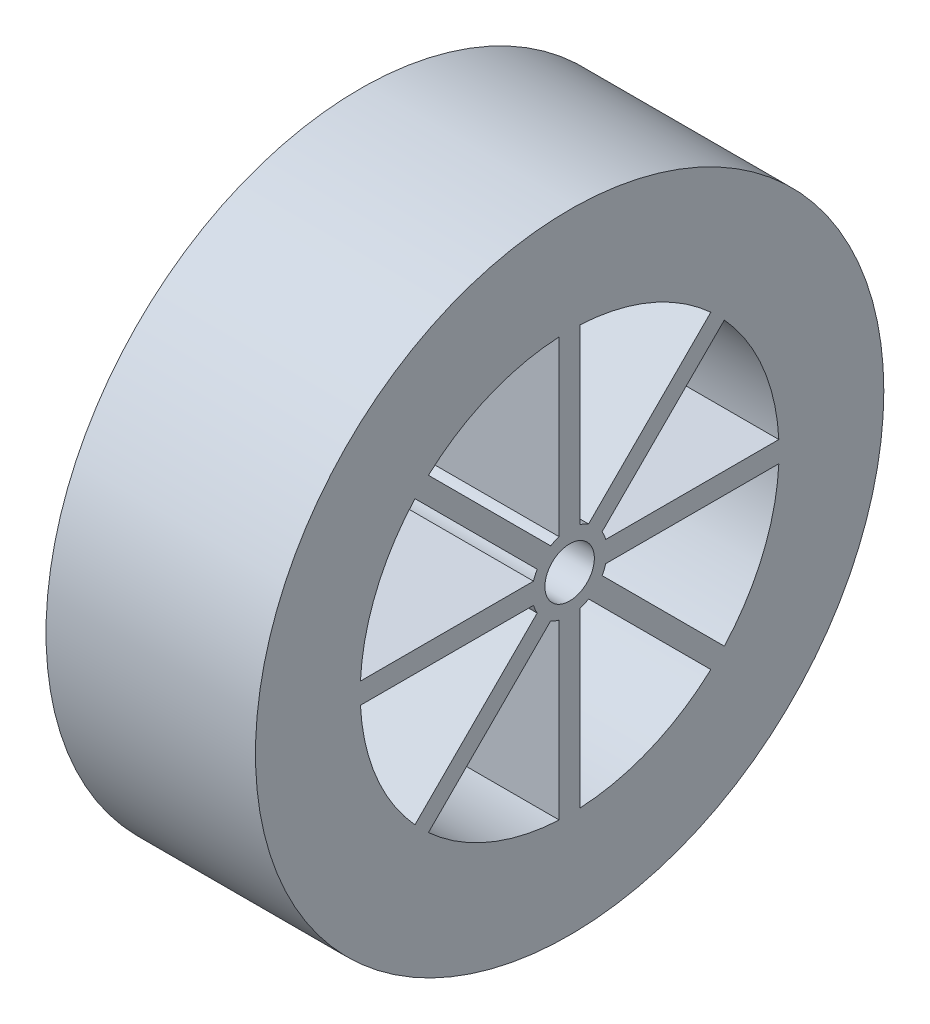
ISO-10303-21;
HEADER;
FILE_DESCRIPTION(('STEP AP214'),'2;1');
FILE_NAME('part.step','',(''),(''),'','','');
FILE_SCHEMA(('AUTOMOTIVE_DESIGN { 1 0 10303 214 1 1 1 1 }'));
ENDSEC;
DATA;
#1=APPLICATION_CONTEXT('core data for automotive mechanical design processes');
#2=APPLICATION_PROTOCOL_DEFINITION('international standard','automotive_design',2000,#1);
#3=PRODUCT_CONTEXT('',#1,'mechanical');
#4=PRODUCT('Part','Part','',(#3));
#5=PRODUCT_RELATED_PRODUCT_CATEGORY('part','',(#4));
#6=PRODUCT_DEFINITION_FORMATION('','',#4);
#7=PRODUCT_DEFINITION_CONTEXT('part definition',#1,'design');
#8=PRODUCT_DEFINITION('design','',#6,#7);
#9=PRODUCT_DEFINITION_SHAPE('','',#8);
#10=(LENGTH_UNIT() NAMED_UNIT(*) SI_UNIT(.MILLI.,.METRE.));
#11=(NAMED_UNIT(*) PLANE_ANGLE_UNIT() SI_UNIT($,.RADIAN.));
#12=(NAMED_UNIT(*) SI_UNIT($,.STERADIAN.) SOLID_ANGLE_UNIT());
#13=UNCERTAINTY_MEASURE_WITH_UNIT(LENGTH_MEASURE(1.E-05),#10,'distance_accuracy_value','');
#14=(GEOMETRIC_REPRESENTATION_CONTEXT(3) GLOBAL_UNCERTAINTY_ASSIGNED_CONTEXT((#13)) GLOBAL_UNIT_ASSIGNED_CONTEXT((#10,
#11,#12)) REPRESENTATION_CONTEXT('',''));
#15=CARTESIAN_POINT('',(0.,0.,0.));
#16=DIRECTION('',(0.,0.,1.));
#17=DIRECTION('',(1.,0.,0.));
#18=AXIS2_PLACEMENT_3D('',#15,#16,#17);
#19=CARTESIAN_POINT('',(12.7,0.,0.));
#20=DIRECTION('',(-1.,0.,0.));
#21=DIRECTION('',(0.,0.,1.));
#22=AXIS2_PLACEMENT_3D('',#19,#20,#21);
#23=CYLINDRICAL_SURFACE('',#22,2.28043976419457);
#24=CARTESIAN_POINT('',(0.,0.,0.));
#25=DIRECTION('',(1.,0.,0.));
#26=DIRECTION('',(0.,0.,-1.));
#27=AXIS2_PLACEMENT_3D('',#24,#25,#26);
#28=CIRCLE('',#27,2.28043976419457);
#29=CARTESIAN_POINT('',(0.,-1.15159574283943,-1.96830708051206));
#30=VERTEX_POINT('',#29);
#31=CARTESIAN_POINT('',(0.,-0.635,-2.19024667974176));
#32=VERTEX_POINT('',#31);
#33=EDGE_CURVE('E296',#30,#32,#28,.T.);
#34=ORIENTED_EDGE('',*,*,#33,.T.);
#35=DIRECTION('',(-1.,0.,0.));
#36=VECTOR('',#35,1.);
#37=CARTESIAN_POINT('',(12.7,-0.635,-2.19024667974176));
#38=LINE('',#37,#36);
#39=CARTESIAN_POINT('',(12.7,-0.635,-2.19024667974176));
#40=VERTEX_POINT('',#39);
#41=EDGE_CURVE('E11',#40,#32,#38,.T.);
#42=ORIENTED_EDGE('',*,*,#41,.F.);
#43=CARTESIAN_POINT('',(12.7,0.,0.));
#44=DIRECTION('',(1.,0.,0.));
#45=DIRECTION('',(0.,0.,-1.));
#46=AXIS2_PLACEMENT_3D('',#43,#44,#45);
#47=CIRCLE('',#46,2.28043976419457);
#48=CARTESIAN_POINT('',(12.7,-1.15159574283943,-1.96830708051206));
#49=VERTEX_POINT('',#48);
#50=EDGE_CURVE('E269',#49,#40,#47,.T.);
#51=ORIENTED_EDGE('',*,*,#50,.F.);
#52=DIRECTION('',(-1.,0.,0.));
#53=VECTOR('',#52,1.);
#54=CARTESIAN_POINT('',(12.7,-1.15159574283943,-1.96830708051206));
#55=LINE('',#54,#53);
#56=EDGE_CURVE('E63',#49,#30,#55,.T.);
#57=ORIENTED_EDGE('',*,*,#56,.T.);
#58=EDGE_LOOP('',(#34,#42,#51,#57));
#59=FACE_BOUND('',#58,.T.);
#60=ADVANCED_FACE('F44',(#59),#23,.T.);
#61=CARTESIAN_POINT('',(12.7,-0.635,0.));
#62=DIRECTION('',(0.,1.,0.));
#63=DIRECTION('',(0.,0.,1.));
#64=AXIS2_PLACEMENT_3D('',#61,#62,#63);
#65=PLANE('',#64);
#66=DIRECTION('',(0.,0.,-1.));
#67=VECTOR('',#66,1.);
#68=CARTESIAN_POINT('',(0.,-0.635,0.));
#69=LINE('',#68,#67);
#70=CARTESIAN_POINT('',(0.,-0.635,-12.6841150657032));
#71=VERTEX_POINT('',#70);
#72=EDGE_CURVE('E277',#32,#71,#69,.T.);
#73=ORIENTED_EDGE('',*,*,#72,.T.);
#74=DIRECTION('',(-1.,0.,0.));
#75=VECTOR('',#74,1.);
#76=CARTESIAN_POINT('',(12.7,-0.635,-12.6841150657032));
#77=LINE('',#76,#75);
#78=CARTESIAN_POINT('',(12.7,-0.635,-12.6841150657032));
#79=VERTEX_POINT('',#78);
#80=EDGE_CURVE('E54',#79,#71,#77,.T.);
#81=ORIENTED_EDGE('',*,*,#80,.F.);
#82=DIRECTION('',(0.,0.,-1.));
#83=VECTOR('',#82,1.);
#84=CARTESIAN_POINT('',(12.7,-0.635,0.));
#85=LINE('',#84,#83);
#86=EDGE_CURVE('E263',#40,#79,#85,.T.);
#87=ORIENTED_EDGE('',*,*,#86,.F.);
#88=ORIENTED_EDGE('',*,*,#41,.T.);
#89=EDGE_LOOP('',(#73,#81,#87,#88));
#90=FACE_BOUND('',#89,.T.);
#91=ADVANCED_FACE('F274',(#90),#65,.F.);
#92=CARTESIAN_POINT('',(12.7,0.,0.));
#93=DIRECTION('',(-1.,0.,0.));
#94=DIRECTION('',(0.,0.,1.));
#95=AXIS2_PLACEMENT_3D('',#92,#93,#94);
#96=CYLINDRICAL_SURFACE('',#95,12.7);
#97=CARTESIAN_POINT('',(0.,0.,0.));
#98=DIRECTION('',(1.,0.,0.));
#99=DIRECTION('',(0.,0.,-1.));
#100=AXIS2_PLACEMENT_3D('',#97,#98,#99);
#101=CIRCLE('',#100,12.7);
#102=CARTESIAN_POINT('',(0.,-8.56261114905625,-9.37932248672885));
#103=VERTEX_POINT('',#102);
#104=EDGE_CURVE('E361',#103,#71,#101,.T.);
#105=ORIENTED_EDGE('',*,*,#104,.F.);
#106=DIRECTION('',(-1.,0.,0.));
#107=VECTOR('',#106,1.);
#108=CARTESIAN_POINT('',(12.7,-8.56261114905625,-9.37932248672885));
#109=LINE('',#108,#107);
#110=CARTESIAN_POINT('',(12.7,-8.56261114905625,-9.37932248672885));
#111=VERTEX_POINT('',#110);
#112=EDGE_CURVE('E165',#111,#103,#109,.T.);
#113=ORIENTED_EDGE('',*,*,#112,.F.);
#114=CARTESIAN_POINT('',(12.7,0.,0.));
#115=DIRECTION('',(1.,0.,0.));
#116=DIRECTION('',(0.,0.,-1.));
#117=AXIS2_PLACEMENT_3D('',#114,#115,#116);
#118=CIRCLE('',#117,12.7);
#119=EDGE_CURVE('E267',#111,#79,#118,.T.);
#120=ORIENTED_EDGE('',*,*,#119,.T.);
#121=ORIENTED_EDGE('',*,*,#80,.T.);
#122=EDGE_LOOP('',(#105,#113,#120,#121));
#123=FACE_BOUND('',#122,.T.);
#124=ADVANCED_FACE('F278',(#123),#96,.F.);
#125=CARTESIAN_POINT('',(12.7,0.,-0.635));
#126=DIRECTION('',(0.,0.,1.));
#127=DIRECTION('',(1.,0.,0.));
#128=AXIS2_PLACEMENT_3D('',#125,#126,#127);
#129=PLANE('',#128);
#130=DIRECTION('',(0.,1.,0.));
#131=VECTOR('',#130,1.);
#132=CARTESIAN_POINT('',(0.,0.,-0.635));
#133=LINE('',#132,#131);
#134=CARTESIAN_POINT('',(0.,-12.6841150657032,-0.635));
#135=VERTEX_POINT('',#134);
#136=CARTESIAN_POINT('',(0.,-2.19024667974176,-0.635));
#137=VERTEX_POINT('',#136);
#138=EDGE_CURVE('E355',#135,#137,#133,.T.);
#139=ORIENTED_EDGE('',*,*,#138,.T.);
#140=DIRECTION('',(-1.,0.,0.));
#141=VECTOR('',#140,1.);
#142=CARTESIAN_POINT('',(12.7,-2.19024667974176,-0.635));
#143=LINE('',#142,#141);
#144=CARTESIAN_POINT('',(12.7,-2.19024667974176,-0.635));
#145=VERTEX_POINT('',#144);
#146=EDGE_CURVE('E373',#145,#137,#143,.T.);
#147=ORIENTED_EDGE('',*,*,#146,.F.);
#148=DIRECTION('',(0.,1.,0.));
#149=VECTOR('',#148,1.);
#150=CARTESIAN_POINT('',(12.7,0.,-0.635));
#151=LINE('',#150,#149);
#152=CARTESIAN_POINT('',(12.7,-12.6841150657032,-0.635));
#153=VERTEX_POINT('',#152);
#154=EDGE_CURVE('E510',#153,#145,#151,.T.);
#155=ORIENTED_EDGE('',*,*,#154,.F.);
#156=DIRECTION('',(-1.,0.,0.));
#157=VECTOR('',#156,1.);
#158=CARTESIAN_POINT('',(12.7,-12.6841150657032,-0.635));
#159=LINE('',#158,#157);
#160=EDGE_CURVE('E374',#153,#135,#159,.T.);
#161=ORIENTED_EDGE('',*,*,#160,.T.);
#162=EDGE_LOOP('',(#139,#147,#155,#161));
#163=FACE_BOUND('',#162,.T.);
#164=ADVANCED_FACE('F587',(#163),#129,.F.);
#165=CARTESIAN_POINT('',(0.,-1.9695081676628,-1.14954038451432));
#166=VERTEX_POINT('',#165);
#167=EDGE_CURVE('E354',#137,#166,#28,.T.);
#168=ORIENTED_EDGE('',*,*,#167,.T.);
#169=DIRECTION('',(-1.,0.,0.));
#170=VECTOR('',#169,1.);
#171=CARTESIAN_POINT('',(12.7,-1.9695081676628,-1.14954038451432));
#172=LINE('',#171,#170);
#173=CARTESIAN_POINT('',(12.7,-1.9695081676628,-1.14954038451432));
#174=VERTEX_POINT('',#173);
#175=EDGE_CURVE('E379',#174,#166,#172,.T.);
#176=ORIENTED_EDGE('',*,*,#175,.F.);
#177=EDGE_CURVE('E507',#145,#174,#47,.T.);
#178=ORIENTED_EDGE('',*,*,#177,.F.);
#179=ORIENTED_EDGE('',*,*,#146,.T.);
#180=EDGE_LOOP('',(#168,#176,#178,#179));
#181=FACE_BOUND('',#180,.T.);
#182=ADVANCED_FACE('F582',(#181),#23,.T.);
#183=CARTESIAN_POINT('',(12.7,-0.409983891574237,0.409983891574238));
#184=DIRECTION('',(0.,0.707106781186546,-0.707106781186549));
#185=DIRECTION('',(0.,0.707106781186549,0.707106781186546));
#186=AXIS2_PLACEMENT_3D('',#183,#184,#185);
#187=PLANE('',#186);
#188=DIRECTION('',(0.,-0.707106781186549,-0.707106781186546));
#189=VECTOR('',#188,1.);
#190=CARTESIAN_POINT('',(0.,-0.409983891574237,0.409983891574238));
#191=LINE('',#190,#189);
#192=CARTESIAN_POINT('',(0.,-9.38087644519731,-8.5609086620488));
#193=VERTEX_POINT('',#192);
#194=EDGE_CURVE('E358',#166,#193,#191,.T.);
#195=ORIENTED_EDGE('',*,*,#194,.T.);
#196=DIRECTION('',(-1.,0.,0.));
#197=VECTOR('',#196,1.);
#198=CARTESIAN_POINT('',(12.7,-9.38087644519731,-8.5609086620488));
#199=LINE('',#198,#197);
#200=CARTESIAN_POINT('',(12.7,-9.38087644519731,-8.5609086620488));
#201=VERTEX_POINT('',#200);
#202=EDGE_CURVE('E380',#201,#193,#199,.T.);
#203=ORIENTED_EDGE('',*,*,#202,.F.);
#204=DIRECTION('',(0.,-0.707106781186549,-0.707106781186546));
#205=VECTOR('',#204,1.);
#206=CARTESIAN_POINT('',(12.7,-0.409983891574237,0.409983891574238));
#207=LINE('',#206,#205);
#208=EDGE_CURVE('E512',#174,#201,#207,.T.);
#209=ORIENTED_EDGE('',*,*,#208,.F.);
#210=ORIENTED_EDGE('',*,*,#175,.T.);
#211=EDGE_LOOP('',(#195,#203,#209,#210));
#212=FACE_BOUND('',#211,.T.);
#213=ADVANCED_FACE('F589',(#212),#187,.F.);
#214=CARTESIAN_POINT('',(12.7,-0.409983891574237,-0.409983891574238));
#215=DIRECTION('',(0.,-0.707106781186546,-0.707106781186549));
#216=DIRECTION('',(0.,0.707106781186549,-0.707106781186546));
#217=AXIS2_PLACEMENT_3D('',#214,#215,#216);
#218=PLANE('',#217);
#219=DIRECTION('',(0.,-0.707106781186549,0.707106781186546));
#220=VECTOR('',#219,1.);
#221=CARTESIAN_POINT('',(0.,-0.409983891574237,-0.409983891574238));
#222=LINE('',#221,#220);
#223=CARTESIAN_POINT('',(0.,-1.9695081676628,1.14954038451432));
#224=VERTEX_POINT('',#223);
#225=CARTESIAN_POINT('',(0.,-9.38087644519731,8.5609086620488));
#226=VERTEX_POINT('',#225);
#227=EDGE_CURVE('E345',#224,#226,#222,.T.);
#228=ORIENTED_EDGE('',*,*,#227,.F.);
#229=DIRECTION('',(-1.,0.,0.));
#230=VECTOR('',#229,1.);
#231=CARTESIAN_POINT('',(12.7,-1.9695081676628,1.14954038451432));
#232=LINE('',#231,#230);
#233=CARTESIAN_POINT('',(12.7,-1.9695081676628,1.14954038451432));
#234=VERTEX_POINT('',#233);
#235=EDGE_CURVE('E378',#234,#224,#232,.T.);
#236=ORIENTED_EDGE('',*,*,#235,.F.);
#237=DIRECTION('',(0.,-0.707106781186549,0.707106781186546));
#238=VECTOR('',#237,1.);
#239=CARTESIAN_POINT('',(12.7,-0.409983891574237,-0.409983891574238));
#240=LINE('',#239,#238);
#241=CARTESIAN_POINT('',(12.7,-9.38087644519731,8.5609086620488));
#242=VERTEX_POINT('',#241);
#243=EDGE_CURVE('E500',#234,#242,#240,.T.);
#244=ORIENTED_EDGE('',*,*,#243,.T.);
#245=DIRECTION('',(-1.,0.,0.));
#246=VECTOR('',#245,1.);
#247=CARTESIAN_POINT('',(12.7,-9.38087644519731,8.5609086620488));
#248=LINE('',#247,#246);
#249=EDGE_CURVE('E384',#242,#226,#248,.T.);
#250=ORIENTED_EDGE('',*,*,#249,.T.);
#251=EDGE_LOOP('',(#228,#236,#244,#250));
#252=FACE_BOUND('',#251,.T.);
#253=ADVANCED_FACE('F596',(#252),#218,.T.);
#254=CARTESIAN_POINT('',(0.,-2.19024667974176,0.635));
#255=VERTEX_POINT('',#254);
#256=EDGE_CURVE('E342',#224,#255,#28,.T.);
#257=ORIENTED_EDGE('',*,*,#256,.T.);
#258=DIRECTION('',(-1.,0.,0.));
#259=VECTOR('',#258,1.);
#260=CARTESIAN_POINT('',(12.7,-2.19024667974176,0.635));
#261=LINE('',#260,#259);
#262=CARTESIAN_POINT('',(12.7,-2.19024667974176,0.635));
#263=VERTEX_POINT('',#262);
#264=EDGE_CURVE('E388',#263,#255,#261,.T.);
#265=ORIENTED_EDGE('',*,*,#264,.F.);
#266=EDGE_CURVE('E498',#234,#263,#47,.T.);
#267=ORIENTED_EDGE('',*,*,#266,.F.);
#268=ORIENTED_EDGE('',*,*,#235,.T.);
#269=EDGE_LOOP('',(#257,#265,#267,#268));
#270=FACE_BOUND('',#269,.T.);
#271=ADVANCED_FACE('F591',(#270),#23,.T.);
#272=CARTESIAN_POINT('',(12.7,0.,0.635));
#273=DIRECTION('',(0.,0.,1.));
#274=DIRECTION('',(0.,-1.,0.));
#275=AXIS2_PLACEMENT_3D('',#272,#273,#274);
#276=PLANE('',#275);
#277=DIRECTION('',(0.,1.,0.));
#278=VECTOR('',#277,1.);
#279=CARTESIAN_POINT('',(0.,0.,0.635));
#280=LINE('',#279,#278);
#281=CARTESIAN_POINT('',(0.,-12.6841150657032,0.635));
#282=VERTEX_POINT('',#281);
#283=EDGE_CURVE('E347',#282,#255,#280,.T.);
#284=ORIENTED_EDGE('',*,*,#283,.F.);
#285=DIRECTION('',(-1.,0.,0.));
#286=VECTOR('',#285,1.);
#287=CARTESIAN_POINT('',(12.7,-12.6841150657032,0.635));
#288=LINE('',#287,#286);
#289=CARTESIAN_POINT('',(12.7,-12.6841150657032,0.635));
#290=VERTEX_POINT('',#289);
#291=EDGE_CURVE('E390',#290,#282,#288,.T.);
#292=ORIENTED_EDGE('',*,*,#291,.F.);
#293=DIRECTION('',(0.,1.,0.));
#294=VECTOR('',#293,1.);
#295=CARTESIAN_POINT('',(12.7,0.,0.635));
#296=LINE('',#295,#294);
#297=EDGE_CURVE('E501',#290,#263,#296,.T.);
#298=ORIENTED_EDGE('',*,*,#297,.T.);
#299=ORIENTED_EDGE('',*,*,#264,.T.);
#300=EDGE_LOOP('',(#284,#292,#298,#299));
#301=FACE_BOUND('',#300,.T.);
#302=ADVANCED_FACE('F605',(#301),#276,.T.);
#303=CARTESIAN_POINT('',(12.7,-0.635,0.));
#304=DIRECTION('',(0.,1.,0.));
#305=DIRECTION('',(0.,0.,1.));
#306=AXIS2_PLACEMENT_3D('',#303,#304,#305);
#307=PLANE('',#306);
#308=DIRECTION('',(0.,0.,-1.));
#309=VECTOR('',#308,1.);
#310=CARTESIAN_POINT('',(0.,-0.635,0.));
#311=LINE('',#310,#309);
#312=CARTESIAN_POINT('',(0.,-0.635,12.6841150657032));
#313=VERTEX_POINT('',#312);
#314=CARTESIAN_POINT('',(0.,-0.635,2.19024667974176));
#315=VERTEX_POINT('',#314);
#316=EDGE_CURVE('E335',#313,#315,#311,.T.);
#317=ORIENTED_EDGE('',*,*,#316,.T.);
#318=DIRECTION('',(-1.,0.,0.));
#319=VECTOR('',#318,1.);
#320=CARTESIAN_POINT('',(12.7,-0.635,2.19024667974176));
#321=LINE('',#320,#319);
#322=CARTESIAN_POINT('',(12.7,-0.635,2.19024667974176));
#323=VERTEX_POINT('',#322);
#324=EDGE_CURVE('E389',#323,#315,#321,.T.);
#325=ORIENTED_EDGE('',*,*,#324,.F.);
#326=DIRECTION('',(0.,0.,-1.));
#327=VECTOR('',#326,1.);
#328=CARTESIAN_POINT('',(12.7,-0.635,0.));
#329=LINE('',#328,#327);
#330=CARTESIAN_POINT('',(12.7,-0.635,12.6841150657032));
#331=VERTEX_POINT('',#330);
#332=EDGE_CURVE('E488',#331,#323,#329,.T.);
#333=ORIENTED_EDGE('',*,*,#332,.F.);
#334=DIRECTION('',(-1.,0.,0.));
#335=VECTOR('',#334,1.);
#336=CARTESIAN_POINT('',(12.7,-0.635,12.6841150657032));
#337=LINE('',#336,#335);
#338=EDGE_CURVE('E392',#331,#313,#337,.T.);
#339=ORIENTED_EDGE('',*,*,#338,.T.);
#340=EDGE_LOOP('',(#317,#325,#333,#339));
#341=FACE_BOUND('',#340,.T.);
#342=ADVANCED_FACE('F609',(#341),#307,.F.);
#343=CARTESIAN_POINT('',(0.,-1.15159574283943,1.96830708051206));
#344=VERTEX_POINT('',#343);
#345=EDGE_CURVE('E333',#315,#344,#28,.T.);
#346=ORIENTED_EDGE('',*,*,#345,.T.);
#347=DIRECTION('',(-1.,0.,0.));
#348=VECTOR('',#347,1.);
#349=CARTESIAN_POINT('',(12.7,-1.15159574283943,1.96830708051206));
#350=LINE('',#349,#348);
#351=CARTESIAN_POINT('',(12.7,-1.15159574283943,1.96830708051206));
#352=VERTEX_POINT('',#351);
#353=EDGE_CURVE('E396',#352,#344,#350,.T.);
#354=ORIENTED_EDGE('',*,*,#353,.F.);
#355=EDGE_CURVE('E491',#323,#352,#47,.T.);
#356=ORIENTED_EDGE('',*,*,#355,.F.);
#357=ORIENTED_EDGE('',*,*,#324,.T.);
#358=EDGE_LOOP('',(#346,#354,#356,#357));
#359=FACE_BOUND('',#358,.T.);
#360=ADVANCED_FACE('F602',(#359),#23,.T.);
#361=CARTESIAN_POINT('',(12.7,0.408355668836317,0.408355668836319));
#362=DIRECTION('',(0.,-0.707106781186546,-0.707106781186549));
#363=DIRECTION('',(0.,0.707106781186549,-0.707106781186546));
#364=AXIS2_PLACEMENT_3D('',#361,#362,#363);
#365=PLANE('',#364);
#366=DIRECTION('',(0.,-0.707106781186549,0.707106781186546));
#367=VECTOR('',#366,1.);
#368=CARTESIAN_POINT('',(0.,0.408355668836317,0.408355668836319));
#369=LINE('',#368,#367);
#370=CARTESIAN_POINT('',(0.,-8.56261114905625,9.37932248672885));
#371=VERTEX_POINT('',#370);
#372=EDGE_CURVE('E336',#344,#371,#369,.T.);
#373=ORIENTED_EDGE('',*,*,#372,.T.);
#374=DIRECTION('',(-1.,0.,0.));
#375=VECTOR('',#374,1.);
#376=CARTESIAN_POINT('',(12.7,-8.56261114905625,9.37932248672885));
#377=LINE('',#376,#375);
#378=CARTESIAN_POINT('',(12.7,-8.56261114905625,9.37932248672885));
#379=VERTEX_POINT('',#378);
#380=EDGE_CURVE('E394',#379,#371,#377,.T.);
#381=ORIENTED_EDGE('',*,*,#380,.F.);
#382=DIRECTION('',(0.,-0.707106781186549,0.707106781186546));
#383=VECTOR('',#382,1.);
#384=CARTESIAN_POINT('',(12.7,0.408355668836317,0.408355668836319));
#385=LINE('',#384,#383);
#386=EDGE_CURVE('E495',#352,#379,#385,.T.);
#387=ORIENTED_EDGE('',*,*,#386,.F.);
#388=ORIENTED_EDGE('',*,*,#353,.T.);
#389=EDGE_LOOP('',(#373,#381,#387,#388));
#390=FACE_BOUND('',#389,.T.);
#391=ADVANCED_FACE('F613',(#390),#365,.F.);
#392=CARTESIAN_POINT('',(12.7,-0.408355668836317,0.408355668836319));
#393=DIRECTION('',(0.,-0.707106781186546,0.707106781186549));
#394=DIRECTION('',(0.,-0.707106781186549,-0.707106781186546));
#395=AXIS2_PLACEMENT_3D('',#392,#393,#394);
#396=PLANE('',#395);
#397=DIRECTION('',(0.,0.707106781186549,0.707106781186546));
#398=VECTOR('',#397,1.);
#399=CARTESIAN_POINT('',(0.,-0.408355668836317,0.408355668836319));
#400=LINE('',#399,#398);
#401=CARTESIAN_POINT('',(0.,1.15159574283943,1.96830708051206));
#402=VERTEX_POINT('',#401);
#403=CARTESIAN_POINT('',(0.,8.56261114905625,9.37932248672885));
#404=VERTEX_POINT('',#403);
#405=EDGE_CURVE('E325',#402,#404,#400,.T.);
#406=ORIENTED_EDGE('',*,*,#405,.F.);
#407=DIRECTION('',(-1.,0.,0.));
#408=VECTOR('',#407,1.);
#409=CARTESIAN_POINT('',(12.7,1.15159574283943,1.96830708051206));
#410=LINE('',#409,#408);
#411=CARTESIAN_POINT('',(12.7,1.15159574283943,1.96830708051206));
#412=VERTEX_POINT('',#411);
#413=EDGE_CURVE('E398',#412,#402,#410,.T.);
#414=ORIENTED_EDGE('',*,*,#413,.F.);
#415=DIRECTION('',(0.,0.707106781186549,0.707106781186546));
#416=VECTOR('',#415,1.);
#417=CARTESIAN_POINT('',(12.7,-0.408355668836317,0.408355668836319));
#418=LINE('',#417,#416);
#419=CARTESIAN_POINT('',(12.7,8.56261114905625,9.37932248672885));
#420=VERTEX_POINT('',#419);
#421=EDGE_CURVE('E476',#412,#420,#418,.T.);
#422=ORIENTED_EDGE('',*,*,#421,.T.);
#423=DIRECTION('',(-1.,0.,0.));
#424=VECTOR('',#423,1.);
#425=CARTESIAN_POINT('',(12.7,8.56261114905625,9.37932248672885));
#426=LINE('',#425,#424);
#427=EDGE_CURVE('E401',#420,#404,#426,.T.);
#428=ORIENTED_EDGE('',*,*,#427,.T.);
#429=EDGE_LOOP('',(#406,#414,#422,#428));
#430=FACE_BOUND('',#429,.T.);
#431=ADVANCED_FACE('F617',(#430),#396,.T.);
#432=CARTESIAN_POINT('',(0.,0.635,2.19024667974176));
#433=VERTEX_POINT('',#432);
#434=EDGE_CURVE('E324',#402,#433,#28,.T.);
#435=ORIENTED_EDGE('',*,*,#434,.T.);
#436=DIRECTION('',(-1.,0.,0.));
#437=VECTOR('',#436,1.);
#438=CARTESIAN_POINT('',(12.7,0.635,2.19024667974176));
#439=LINE('',#438,#437);
#440=CARTESIAN_POINT('',(12.7,0.635,2.19024667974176));
#441=VERTEX_POINT('',#440);
#442=EDGE_CURVE('E407',#441,#433,#439,.T.);
#443=ORIENTED_EDGE('',*,*,#442,.F.);
#444=EDGE_CURVE('E481',#412,#441,#47,.T.);
#445=ORIENTED_EDGE('',*,*,#444,.F.);
#446=ORIENTED_EDGE('',*,*,#413,.T.);
#447=EDGE_LOOP('',(#435,#443,#445,#446));
#448=FACE_BOUND('',#447,.T.);
#449=ADVANCED_FACE('F614',(#448),#23,.T.);
#450=CARTESIAN_POINT('',(12.7,0.635,0.));
#451=DIRECTION('',(0.,1.,0.));
#452=DIRECTION('',(0.,0.,1.));
#453=AXIS2_PLACEMENT_3D('',#450,#451,#452);
#454=PLANE('',#453);
#455=DIRECTION('',(0.,0.,-1.));
#456=VECTOR('',#455,1.);
#457=CARTESIAN_POINT('',(0.,0.635,0.));
#458=LINE('',#457,#456);
#459=CARTESIAN_POINT('',(0.,0.635,12.6841150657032));
#460=VERTEX_POINT('',#459);
#461=EDGE_CURVE('E326',#460,#433,#458,.T.);
#462=ORIENTED_EDGE('',*,*,#461,.F.);
#463=DIRECTION('',(-1.,0.,0.));
#464=VECTOR('',#463,1.);
#465=CARTESIAN_POINT('',(12.7,0.635,12.6841150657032));
#466=LINE('',#465,#464);
#467=CARTESIAN_POINT('',(12.7,0.635,12.6841150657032));
#468=VERTEX_POINT('',#467);
#469=EDGE_CURVE('E403',#468,#460,#466,.T.);
#470=ORIENTED_EDGE('',*,*,#469,.F.);
#471=DIRECTION('',(0.,0.,-1.));
#472=VECTOR('',#471,1.);
#473=CARTESIAN_POINT('',(12.7,0.635,0.));
#474=LINE('',#473,#472);
#475=EDGE_CURVE('E485',#468,#441,#474,.T.);
#476=ORIENTED_EDGE('',*,*,#475,.T.);
#477=ORIENTED_EDGE('',*,*,#442,.T.);
#478=EDGE_LOOP('',(#462,#470,#476,#477));
#479=FACE_BOUND('',#478,.T.);
#480=ADVANCED_FACE('F626',(#479),#454,.T.);
#481=CARTESIAN_POINT('',(12.7,0.,0.635));
#482=DIRECTION('',(0.,0.,1.));
#483=DIRECTION('',(0.,-1.,0.));
#484=AXIS2_PLACEMENT_3D('',#481,#482,#483);
#485=PLANE('',#484);
#486=DIRECTION('',(0.,1.,0.));
#487=VECTOR('',#486,1.);
#488=CARTESIAN_POINT('',(0.,0.,0.635));
#489=LINE('',#488,#487);
#490=CARTESIAN_POINT('',(0.,2.19024667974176,0.635));
#491=VERTEX_POINT('',#490);
#492=CARTESIAN_POINT('',(0.,12.6841150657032,0.635));
#493=VERTEX_POINT('',#492);
#494=EDGE_CURVE('E315',#491,#493,#489,.T.);
#495=ORIENTED_EDGE('',*,*,#494,.F.);
#496=DIRECTION('',(-1.,0.,0.));
#497=VECTOR('',#496,1.);
#498=CARTESIAN_POINT('',(12.7,2.19024667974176,0.635));
#499=LINE('',#498,#497);
#500=CARTESIAN_POINT('',(12.7,2.19024667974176,0.635));
#501=VERTEX_POINT('',#500);
#502=EDGE_CURVE('E406',#501,#491,#499,.T.);
#503=ORIENTED_EDGE('',*,*,#502,.F.);
#504=DIRECTION('',(0.,1.,0.));
#505=VECTOR('',#504,1.);
#506=CARTESIAN_POINT('',(12.7,0.,0.635));
#507=LINE('',#506,#505);
#508=CARTESIAN_POINT('',(12.7,12.6841150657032,0.635));
#509=VERTEX_POINT('',#508);
#510=EDGE_CURVE('E469',#501,#509,#507,.T.);
#511=ORIENTED_EDGE('',*,*,#510,.T.);
#512=DIRECTION('',(-1.,0.,0.));
#513=VECTOR('',#512,1.);
#514=CARTESIAN_POINT('',(12.7,12.6841150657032,0.635));
#515=LINE('',#514,#513);
#516=EDGE_CURVE('E413',#509,#493,#515,.T.);
#517=ORIENTED_EDGE('',*,*,#516,.T.);
#518=EDGE_LOOP('',(#495,#503,#511,#517));
#519=FACE_BOUND('',#518,.T.);
#520=ADVANCED_FACE('F635',(#519),#485,.T.);
#521=CARTESIAN_POINT('',(0.,1.9695081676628,1.14954038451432));
#522=VERTEX_POINT('',#521);
#523=EDGE_CURVE('E312',#491,#522,#28,.T.);
#524=ORIENTED_EDGE('',*,*,#523,.T.);
#525=DIRECTION('',(-1.,0.,0.));
#526=VECTOR('',#525,1.);
#527=CARTESIAN_POINT('',(12.7,1.9695081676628,1.14954038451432));
#528=LINE('',#527,#526);
#529=CARTESIAN_POINT('',(12.7,1.9695081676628,1.14954038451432));
#530=VERTEX_POINT('',#529);
#531=EDGE_CURVE('E418',#530,#522,#528,.T.);
#532=ORIENTED_EDGE('',*,*,#531,.F.);
#533=EDGE_CURVE('E472',#501,#530,#47,.T.);
#534=ORIENTED_EDGE('',*,*,#533,.F.);
#535=ORIENTED_EDGE('',*,*,#502,.T.);
#536=EDGE_LOOP('',(#524,#532,#534,#535));
#537=FACE_BOUND('',#536,.T.);
#538=ADVANCED_FACE('F630',(#537),#23,.T.);
#539=CARTESIAN_POINT('',(12.7,0.409983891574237,-0.409983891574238));
#540=DIRECTION('',(0.,-0.707106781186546,0.707106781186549));
#541=DIRECTION('',(0.,-0.707106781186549,-0.707106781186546));
#542=AXIS2_PLACEMENT_3D('',#539,#540,#541);
#543=PLANE('',#542);
#544=DIRECTION('',(0.,0.707106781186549,0.707106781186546));
#545=VECTOR('',#544,1.);
#546=CARTESIAN_POINT('',(0.,0.409983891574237,-0.409983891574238));
#547=LINE('',#546,#545);
#548=CARTESIAN_POINT('',(0.,9.38087644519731,8.5609086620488));
#549=VERTEX_POINT('',#548);
#550=EDGE_CURVE('E316',#522,#549,#547,.T.);
#551=ORIENTED_EDGE('',*,*,#550,.T.);
#552=DIRECTION('',(-1.,0.,0.));
#553=VECTOR('',#552,1.);
#554=CARTESIAN_POINT('',(12.7,9.38087644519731,8.5609086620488));
#555=LINE('',#554,#553);
#556=CARTESIAN_POINT('',(12.7,9.38087644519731,8.5609086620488));
#557=VERTEX_POINT('',#556);
#558=EDGE_CURVE('E411',#557,#549,#555,.T.);
#559=ORIENTED_EDGE('',*,*,#558,.F.);
#560=DIRECTION('',(0.,0.707106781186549,0.707106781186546));
#561=VECTOR('',#560,1.);
#562=CARTESIAN_POINT('',(12.7,0.409983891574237,-0.409983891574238));
#563=LINE('',#562,#561);
#564=EDGE_CURVE('E471',#530,#557,#563,.T.);
#565=ORIENTED_EDGE('',*,*,#564,.F.);
#566=ORIENTED_EDGE('',*,*,#531,.T.);
#567=EDGE_LOOP('',(#551,#559,#565,#566));
#568=FACE_BOUND('',#567,.T.);
#569=ADVANCED_FACE('F636',(#568),#543,.F.);
#570=CARTESIAN_POINT('',(12.7,0.409983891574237,0.409983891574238));
#571=DIRECTION('',(0.,0.707106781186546,0.707106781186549));
#572=DIRECTION('',(0.,-0.707106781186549,0.707106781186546));
#573=AXIS2_PLACEMENT_3D('',#570,#571,#572);
#574=PLANE('',#573);
#575=DIRECTION('',(0.,0.707106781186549,-0.707106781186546));
#576=VECTOR('',#575,1.);
#577=CARTESIAN_POINT('',(0.,0.409983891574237,0.409983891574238));
#578=LINE('',#577,#576);
#579=CARTESIAN_POINT('',(0.,1.9695081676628,-1.14954038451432));
#580=VERTEX_POINT('',#579);
#581=CARTESIAN_POINT('',(0.,9.38087644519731,-8.5609086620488));
#582=VERTEX_POINT('',#581);
#583=EDGE_CURVE('E301',#580,#582,#578,.T.);
#584=ORIENTED_EDGE('',*,*,#583,.F.);
#585=DIRECTION('',(-1.,0.,0.));
#586=VECTOR('',#585,1.);
#587=CARTESIAN_POINT('',(12.7,1.9695081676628,-1.14954038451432));
#588=LINE('',#587,#586);
#589=CARTESIAN_POINT('',(12.7,1.9695081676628,-1.14954038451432));
#590=VERTEX_POINT('',#589);
#591=EDGE_CURVE('E414',#590,#580,#588,.T.);
#592=ORIENTED_EDGE('',*,*,#591,.F.);
#593=DIRECTION('',(0.,0.707106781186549,-0.707106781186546));
#594=VECTOR('',#593,1.);
#595=CARTESIAN_POINT('',(12.7,0.409983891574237,0.409983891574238));
#596=LINE('',#595,#594);
#597=CARTESIAN_POINT('',(12.7,9.38087644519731,-8.5609086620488));
#598=VERTEX_POINT('',#597);
#599=EDGE_CURVE('E457',#590,#598,#596,.T.);
#600=ORIENTED_EDGE('',*,*,#599,.T.);
#601=DIRECTION('',(-1.,0.,0.));
#602=VECTOR('',#601,1.);
#603=CARTESIAN_POINT('',(12.7,9.38087644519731,-8.5609086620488));
#604=LINE('',#603,#602);
#605=EDGE_CURVE('E419',#598,#582,#604,.T.);
#606=ORIENTED_EDGE('',*,*,#605,.T.);
#607=EDGE_LOOP('',(#584,#592,#600,#606));
#608=FACE_BOUND('',#607,.T.);
#609=ADVANCED_FACE('F554',(#608),#574,.T.);
#610=CARTESIAN_POINT('',(0.,2.19024667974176,-0.635));
#611=VERTEX_POINT('',#610);
#612=EDGE_CURVE('E300',#580,#611,#28,.T.);
#613=ORIENTED_EDGE('',*,*,#612,.T.);
#614=DIRECTION('',(-1.,0.,0.));
#615=VECTOR('',#614,1.);
#616=CARTESIAN_POINT('',(12.7,2.19024667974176,-0.635));
#617=LINE('',#616,#615);
#618=CARTESIAN_POINT('',(12.7,2.19024667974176,-0.635));
#619=VERTEX_POINT('',#618);
#620=EDGE_CURVE('E424',#619,#611,#617,.T.);
#621=ORIENTED_EDGE('',*,*,#620,.F.);
#622=EDGE_CURVE('E459',#590,#619,#47,.T.);
#623=ORIENTED_EDGE('',*,*,#622,.F.);
#624=ORIENTED_EDGE('',*,*,#591,.T.);
#625=EDGE_LOOP('',(#613,#621,#623,#624));
#626=FACE_BOUND('',#625,.T.);
#627=ADVANCED_FACE('F542',(#626),#23,.T.);
#628=CARTESIAN_POINT('',(12.7,0.,-0.635));
#629=DIRECTION('',(0.,0.,1.));
#630=DIRECTION('',(1.,0.,0.));
#631=AXIS2_PLACEMENT_3D('',#628,#629,#630);
#632=PLANE('',#631);
#633=DIRECTION('',(0.,1.,0.));
#634=VECTOR('',#633,1.);
#635=CARTESIAN_POINT('',(0.,0.,-0.635));
#636=LINE('',#635,#634);
#637=CARTESIAN_POINT('',(0.,12.6841150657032,-0.635));
#638=VERTEX_POINT('',#637);
#639=EDGE_CURVE('E308',#611,#638,#636,.T.);
#640=ORIENTED_EDGE('',*,*,#639,.T.);
#641=DIRECTION('',(-1.,0.,0.));
#642=VECTOR('',#641,1.);
#643=CARTESIAN_POINT('',(12.7,12.6841150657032,-0.635));
#644=LINE('',#643,#642);
#645=CARTESIAN_POINT('',(12.7,12.6841150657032,-0.635));
#646=VERTEX_POINT('',#645);
#647=EDGE_CURVE('E425',#646,#638,#644,.T.);
#648=ORIENTED_EDGE('',*,*,#647,.F.);
#649=DIRECTION('',(0.,1.,0.));
#650=VECTOR('',#649,1.);
#651=CARTESIAN_POINT('',(12.7,0.,-0.635));
#652=LINE('',#651,#650);
#653=EDGE_CURVE('E463',#619,#646,#652,.T.);
#654=ORIENTED_EDGE('',*,*,#653,.F.);
#655=ORIENTED_EDGE('',*,*,#620,.T.);
#656=EDGE_LOOP('',(#640,#648,#654,#655));
#657=FACE_BOUND('',#656,.T.);
#658=ADVANCED_FACE('F550',(#657),#632,.F.);
#659=CARTESIAN_POINT('',(12.7,0.635,0.));
#660=DIRECTION('',(0.,1.,0.));
#661=DIRECTION('',(0.,0.,1.));
#662=AXIS2_PLACEMENT_3D('',#659,#660,#661);
#663=PLANE('',#662);
#664=DIRECTION('',(0.,0.,-1.));
#665=VECTOR('',#664,1.);
#666=CARTESIAN_POINT('',(0.,0.635,0.));
#667=LINE('',#666,#665);
#668=CARTESIAN_POINT('',(0.,0.635,-2.19024667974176));
#669=VERTEX_POINT('',#668);
#670=CARTESIAN_POINT('',(0.,0.635,-12.6841150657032));
#671=VERTEX_POINT('',#670);
#672=EDGE_CURVE('E287',#669,#671,#667,.T.);
#673=ORIENTED_EDGE('',*,*,#672,.F.);
#674=DIRECTION('',(-1.,0.,0.));
#675=VECTOR('',#674,1.);
#676=CARTESIAN_POINT('',(12.7,0.635,-2.19024667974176));
#677=LINE('',#676,#675);
#678=CARTESIAN_POINT('',(12.7,0.635,-2.19024667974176));
#679=VERTEX_POINT('',#678);
#680=EDGE_CURVE('E173',#679,#669,#677,.T.);
#681=ORIENTED_EDGE('',*,*,#680,.F.);
#682=DIRECTION('',(0.,0.,-1.));
#683=VECTOR('',#682,1.);
#684=CARTESIAN_POINT('',(12.7,0.635,0.));
#685=LINE('',#684,#683);
#686=CARTESIAN_POINT('',(12.7,0.635,-12.6841150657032));
#687=VERTEX_POINT('',#686);
#688=EDGE_CURVE('E371',#679,#687,#685,.T.);
#689=ORIENTED_EDGE('',*,*,#688,.T.);
#690=DIRECTION('',(-1.,0.,0.));
#691=VECTOR('',#690,1.);
#692=CARTESIAN_POINT('',(12.7,0.635,-12.6841150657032));
#693=LINE('',#692,#691);
#694=EDGE_CURVE('E289',#687,#671,#693,.T.);
#695=ORIENTED_EDGE('',*,*,#694,.T.);
#696=EDGE_LOOP('',(#673,#681,#689,#695));
#697=FACE_BOUND('',#696,.T.);
#698=ADVANCED_FACE('F50',(#697),#663,.T.);
#699=CARTESIAN_POINT('',(0.,1.15159574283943,-1.96830708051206));
#700=VERTEX_POINT('',#699);
#701=EDGE_CURVE('E291',#669,#700,#28,.T.);
#702=ORIENTED_EDGE('',*,*,#701,.T.);
#703=DIRECTION('',(-1.,0.,0.));
#704=VECTOR('',#703,1.);
#705=CARTESIAN_POINT('',(12.7,1.15159574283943,-1.96830708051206));
#706=LINE('',#705,#704);
#707=CARTESIAN_POINT('',(12.7,1.15159574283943,-1.96830708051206));
#708=VERTEX_POINT('',#707);
#709=EDGE_CURVE('E431',#708,#700,#706,.T.);
#710=ORIENTED_EDGE('',*,*,#709,.F.);
#711=EDGE_CURVE('E440',#679,#708,#47,.T.);
#712=ORIENTED_EDGE('',*,*,#711,.F.);
#713=ORIENTED_EDGE('',*,*,#680,.T.);
#714=EDGE_LOOP('',(#702,#710,#712,#713));
#715=FACE_BOUND('',#714,.T.);
#716=ADVANCED_FACE('F434',(#715),#23,.T.);
#717=CARTESIAN_POINT('',(12.7,-0.408355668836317,-0.408355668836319));
#718=DIRECTION('',(0.,0.707106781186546,0.707106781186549));
#719=DIRECTION('',(0.,-0.707106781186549,0.707106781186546));
#720=AXIS2_PLACEMENT_3D('',#717,#718,#719);
#721=PLANE('',#720);
#722=DIRECTION('',(0.,0.707106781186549,-0.707106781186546));
#723=VECTOR('',#722,1.);
#724=CARTESIAN_POINT('',(0.,-0.408355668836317,-0.408355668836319));
#725=LINE('',#724,#723);
#726=CARTESIAN_POINT('',(0.,8.56261114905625,-9.37932248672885));
#727=VERTEX_POINT('',#726);
#728=EDGE_CURVE('E293',#700,#727,#725,.T.);
#729=ORIENTED_EDGE('',*,*,#728,.T.);
#730=DIRECTION('',(-1.,0.,0.));
#731=VECTOR('',#730,1.);
#732=CARTESIAN_POINT('',(12.7,8.56261114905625,-9.37932248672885));
#733=LINE('',#732,#731);
#734=CARTESIAN_POINT('',(12.7,8.56261114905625,-9.37932248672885));
#735=VERTEX_POINT('',#734);
#736=EDGE_CURVE('E427',#735,#727,#733,.T.);
#737=ORIENTED_EDGE('',*,*,#736,.F.);
#738=DIRECTION('',(0.,0.707106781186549,-0.707106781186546));
#739=VECTOR('',#738,1.);
#740=CARTESIAN_POINT('',(12.7,-0.408355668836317,-0.408355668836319));
#741=LINE('',#740,#739);
#742=EDGE_CURVE('E451',#708,#735,#741,.T.);
#743=ORIENTED_EDGE('',*,*,#742,.F.);
#744=ORIENTED_EDGE('',*,*,#709,.T.);
#745=EDGE_LOOP('',(#729,#737,#743,#744));
#746=FACE_BOUND('',#745,.T.);
#747=ADVANCED_FACE('F455',(#746),#721,.F.);
#748=CARTESIAN_POINT('',(12.7,0.408355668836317,-0.408355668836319));
#749=DIRECTION('',(0.,0.707106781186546,-0.707106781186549));
#750=DIRECTION('',(0.,0.707106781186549,0.707106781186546));
#751=AXIS2_PLACEMENT_3D('',#748,#749,#750);
#752=PLANE('',#751);
#753=DIRECTION('',(0.,-0.707106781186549,-0.707106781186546));
#754=VECTOR('',#753,1.);
#755=CARTESIAN_POINT('',(0.,0.408355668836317,-0.408355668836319));
#756=LINE('',#755,#754);
#757=EDGE_CURVE('E364',#30,#103,#756,.T.);
#758=ORIENTED_EDGE('',*,*,#757,.F.);
#759=ORIENTED_EDGE('',*,*,#56,.F.);
#760=DIRECTION('',(0.,-0.707106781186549,-0.707106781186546));
#761=VECTOR('',#760,1.);
#762=CARTESIAN_POINT('',(12.7,0.408355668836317,-0.408355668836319));
#763=LINE('',#762,#761);
#764=EDGE_CURVE('E281',#49,#111,#763,.T.);
#765=ORIENTED_EDGE('',*,*,#764,.T.);
#766=ORIENTED_EDGE('',*,*,#112,.T.);
#767=EDGE_LOOP('',(#758,#759,#765,#766));
#768=FACE_BOUND('',#767,.T.);
#769=ADVANCED_FACE('F566',(#768),#752,.T.);
#770=CARTESIAN_POINT('',(12.7,0.,0.));
#771=DIRECTION('',(-1.,0.,0.));
#772=DIRECTION('',(0.,0.,1.));
#773=AXIS2_PLACEMENT_3D('',#770,#771,#772);
#774=CYLINDRICAL_SURFACE('',#773,12.7);
#775=CARTESIAN_POINT('',(0.,0.,0.));
#776=DIRECTION('',(1.,0.,0.));
#777=DIRECTION('',(0.,0.,-1.));
#778=AXIS2_PLACEMENT_3D('',#775,#776,#777);
#779=CIRCLE('',#778,12.7);
#780=EDGE_CURVE('E359',#135,#193,#779,.T.);
#781=ORIENTED_EDGE('',*,*,#780,.F.);
#782=ORIENTED_EDGE('',*,*,#160,.F.);
#783=CARTESIAN_POINT('',(12.7,0.,0.));
#784=DIRECTION('',(1.,0.,0.));
#785=DIRECTION('',(0.,0.,-1.));
#786=AXIS2_PLACEMENT_3D('',#783,#784,#785);
#787=CIRCLE('',#786,12.7);
#788=EDGE_CURVE('E515',#153,#201,#787,.T.);
#789=ORIENTED_EDGE('',*,*,#788,.T.);
#790=ORIENTED_EDGE('',*,*,#202,.T.);
#791=EDGE_LOOP('',(#781,#782,#789,#790));
#792=FACE_BOUND('',#791,.T.);
#793=ADVANCED_FACE('F568',(#792),#774,.F.);
#794=CARTESIAN_POINT('',(12.7,0.,0.));
#795=DIRECTION('',(-1.,0.,0.));
#796=DIRECTION('',(0.,0.,1.));
#797=AXIS2_PLACEMENT_3D('',#794,#795,#796);
#798=CYLINDRICAL_SURFACE('',#797,12.7);
#799=CARTESIAN_POINT('',(0.,0.,0.));
#800=DIRECTION('',(1.,0.,0.));
#801=DIRECTION('',(0.,0.,-1.));
#802=AXIS2_PLACEMENT_3D('',#799,#800,#801);
#803=CIRCLE('',#802,12.7);
#804=EDGE_CURVE('E349',#226,#282,#803,.T.);
#805=ORIENTED_EDGE('',*,*,#804,.F.);
#806=ORIENTED_EDGE('',*,*,#249,.F.);
#807=CARTESIAN_POINT('',(12.7,0.,0.));
#808=DIRECTION('',(1.,0.,0.));
#809=DIRECTION('',(0.,0.,-1.));
#810=AXIS2_PLACEMENT_3D('',#807,#808,#809);
#811=CIRCLE('',#810,12.7);
#812=EDGE_CURVE('E503',#242,#290,#811,.T.);
#813=ORIENTED_EDGE('',*,*,#812,.T.);
#814=ORIENTED_EDGE('',*,*,#291,.T.);
#815=EDGE_LOOP('',(#805,#806,#813,#814));
#816=FACE_BOUND('',#815,.T.);
#817=ADVANCED_FACE('F578',(#816),#798,.F.);
#818=CARTESIAN_POINT('',(12.7,0.,0.));
#819=DIRECTION('',(-1.,0.,0.));
#820=DIRECTION('',(0.,0.,1.));
#821=AXIS2_PLACEMENT_3D('',#818,#819,#820);
#822=CYLINDRICAL_SURFACE('',#821,12.7);
#823=CARTESIAN_POINT('',(0.,0.,0.));
#824=DIRECTION('',(1.,0.,0.));
#825=DIRECTION('',(0.,0.,-1.));
#826=AXIS2_PLACEMENT_3D('',#823,#824,#825);
#827=CIRCLE('',#826,12.7);
#828=EDGE_CURVE('E338',#313,#371,#827,.T.);
#829=ORIENTED_EDGE('',*,*,#828,.F.);
#830=ORIENTED_EDGE('',*,*,#338,.F.);
#831=CARTESIAN_POINT('',(12.7,0.,0.));
#832=DIRECTION('',(1.,0.,0.));
#833=DIRECTION('',(0.,0.,-1.));
#834=AXIS2_PLACEMENT_3D('',#831,#832,#833);
#835=CIRCLE('',#834,12.7);
#836=EDGE_CURVE('E493',#331,#379,#835,.T.);
#837=ORIENTED_EDGE('',*,*,#836,.T.);
#838=ORIENTED_EDGE('',*,*,#380,.T.);
#839=EDGE_LOOP('',(#829,#830,#837,#838));
#840=FACE_BOUND('',#839,.T.);
#841=ADVANCED_FACE('F674',(#840),#822,.F.);
#842=CARTESIAN_POINT('',(12.7,0.,0.));
#843=DIRECTION('',(-1.,0.,0.));
#844=DIRECTION('',(0.,0.,1.));
#845=AXIS2_PLACEMENT_3D('',#842,#843,#844);
#846=CYLINDRICAL_SURFACE('',#845,12.7);
#847=CARTESIAN_POINT('',(0.,0.,0.));
#848=DIRECTION('',(1.,0.,0.));
#849=DIRECTION('',(0.,0.,-1.));
#850=AXIS2_PLACEMENT_3D('',#847,#848,#849);
#851=CIRCLE('',#850,12.7);
#852=EDGE_CURVE('E328',#404,#460,#851,.T.);
#853=ORIENTED_EDGE('',*,*,#852,.F.);
#854=ORIENTED_EDGE('',*,*,#427,.F.);
#855=CARTESIAN_POINT('',(12.7,0.,0.));
#856=DIRECTION('',(1.,0.,0.));
#857=DIRECTION('',(0.,0.,-1.));
#858=AXIS2_PLACEMENT_3D('',#855,#856,#857);
#859=CIRCLE('',#858,12.7);
#860=EDGE_CURVE('E484',#420,#468,#859,.T.);
#861=ORIENTED_EDGE('',*,*,#860,.T.);
#862=ORIENTED_EDGE('',*,*,#469,.T.);
#863=EDGE_LOOP('',(#853,#854,#861,#862));
#864=FACE_BOUND('',#863,.T.);
#865=ADVANCED_FACE('F668',(#864),#846,.F.);
#866=CARTESIAN_POINT('',(12.7,0.,0.));
#867=DIRECTION('',(-1.,0.,0.));
#868=DIRECTION('',(0.,0.,1.));
#869=AXIS2_PLACEMENT_3D('',#866,#867,#868);
#870=CYLINDRICAL_SURFACE('',#869,12.7);
#871=CARTESIAN_POINT('',(0.,0.,0.));
#872=DIRECTION('',(1.,0.,0.));
#873=DIRECTION('',(0.,0.,-1.));
#874=AXIS2_PLACEMENT_3D('',#871,#872,#873);
#875=CIRCLE('',#874,12.7);
#876=EDGE_CURVE('E317',#493,#549,#875,.T.);
#877=ORIENTED_EDGE('',*,*,#876,.F.);
#878=ORIENTED_EDGE('',*,*,#516,.F.);
#879=CARTESIAN_POINT('',(12.7,0.,0.));
#880=DIRECTION('',(1.,0.,0.));
#881=DIRECTION('',(0.,0.,-1.));
#882=AXIS2_PLACEMENT_3D('',#879,#880,#881);
#883=CIRCLE('',#882,12.7);
#884=EDGE_CURVE('E474',#509,#557,#883,.T.);
#885=ORIENTED_EDGE('',*,*,#884,.T.);
#886=ORIENTED_EDGE('',*,*,#558,.T.);
#887=EDGE_LOOP('',(#877,#878,#885,#886));
#888=FACE_BOUND('',#887,.T.);
#889=ADVANCED_FACE('F663',(#888),#870,.F.);
#890=CARTESIAN_POINT('',(12.7,0.,0.));
#891=DIRECTION('',(-1.,0.,0.));
#892=DIRECTION('',(0.,0.,1.));
#893=AXIS2_PLACEMENT_3D('',#890,#891,#892);
#894=CYLINDRICAL_SURFACE('',#893,12.7);
#895=CARTESIAN_POINT('',(0.,0.,0.));
#896=DIRECTION('',(1.,0.,0.));
#897=DIRECTION('',(0.,0.,-1.));
#898=AXIS2_PLACEMENT_3D('',#895,#896,#897);
#899=CIRCLE('',#898,12.7);
#900=EDGE_CURVE('E310',#582,#638,#899,.T.);
#901=ORIENTED_EDGE('',*,*,#900,.F.);
#902=ORIENTED_EDGE('',*,*,#605,.F.);
#903=CARTESIAN_POINT('',(12.7,0.,0.));
#904=DIRECTION('',(1.,0.,0.));
#905=DIRECTION('',(0.,0.,-1.));
#906=AXIS2_PLACEMENT_3D('',#903,#904,#905);
#907=CIRCLE('',#906,12.7);
#908=EDGE_CURVE('E468',#598,#646,#907,.T.);
#909=ORIENTED_EDGE('',*,*,#908,.T.);
#910=ORIENTED_EDGE('',*,*,#647,.T.);
#911=EDGE_LOOP('',(#901,#902,#909,#910));
#912=FACE_BOUND('',#911,.T.);
#913=ADVANCED_FACE('F549',(#912),#894,.F.);
#914=CARTESIAN_POINT('',(12.7,0.,0.));
#915=DIRECTION('',(-1.,0.,0.));
#916=DIRECTION('',(0.,0.,1.));
#917=AXIS2_PLACEMENT_3D('',#914,#915,#916);
#918=CYLINDRICAL_SURFACE('',#917,12.7);
#919=CARTESIAN_POINT('',(0.,0.,0.));
#920=DIRECTION('',(1.,0.,0.));
#921=DIRECTION('',(0.,0.,-1.));
#922=AXIS2_PLACEMENT_3D('',#919,#920,#921);
#923=CIRCLE('',#922,12.7);
#924=EDGE_CURVE('E299',#671,#727,#923,.T.);
#925=ORIENTED_EDGE('',*,*,#924,.F.);
#926=ORIENTED_EDGE('',*,*,#694,.F.);
#927=CARTESIAN_POINT('',(12.7,0.,0.));
#928=DIRECTION('',(1.,0.,0.));
#929=DIRECTION('',(0.,0.,-1.));
#930=AXIS2_PLACEMENT_3D('',#927,#928,#929);
#931=CIRCLE('',#930,12.7);
#932=EDGE_CURVE('E447',#687,#735,#931,.T.);
#933=ORIENTED_EDGE('',*,*,#932,.T.);
#934=ORIENTED_EDGE('',*,*,#736,.T.);
#935=EDGE_LOOP('',(#925,#926,#933,#934));
#936=FACE_BOUND('',#935,.T.);
#937=ADVANCED_FACE('F450',(#936),#918,.F.);
#938=CARTESIAN_POINT('',(12.7,0.,0.));
#939=DIRECTION('',(-1.,0.,0.));
#940=DIRECTION('',(0.,0.,1.));
#941=AXIS2_PLACEMENT_3D('',#938,#939,#940);
#942=CYLINDRICAL_SURFACE('',#941,19.05);
#943=CARTESIAN_POINT('',(12.7,0.,0.));
#944=DIRECTION('',(1.,0.,0.));
#945=DIRECTION('',(0.,0.,-1.));
#946=AXIS2_PLACEMENT_3D('',#943,#944,#945);
#947=CIRCLE('',#946,19.05);
#948=CARTESIAN_POINT('',(12.7,0.,-19.05));
#949=VERTEX_POINT('',#948);
#950=EDGE_CURVE('E282',#949,#949,#947,.T.);
#951=ORIENTED_EDGE('',*,*,#950,.F.);
#952=EDGE_LOOP('',(#951));
#953=FACE_BOUND('',#952,.T.);
#954=CARTESIAN_POINT('',(0.,0.,0.));
#955=DIRECTION('',(1.,0.,0.));
#956=DIRECTION('',(0.,0.,-1.));
#957=AXIS2_PLACEMENT_3D('',#954,#955,#956);
#958=CIRCLE('',#957,19.05);
#959=CARTESIAN_POINT('',(0.,0.,-19.05));
#960=VERTEX_POINT('',#959);
#961=EDGE_CURVE('E366',#960,#960,#958,.T.);
#962=ORIENTED_EDGE('',*,*,#961,.T.);
#963=EDGE_LOOP('',(#962));
#964=FACE_BOUND('',#963,.T.);
#965=ADVANCED_FACE('F658',(#953,#964),#942,.T.);
#966=CARTESIAN_POINT('',(12.7,0.,0.));
#967=DIRECTION('',(1.,0.,0.));
#968=DIRECTION('',(0.,0.,-1.));
#969=AXIS2_PLACEMENT_3D('',#966,#967,#968);
#970=PLANE('',#969);
#971=CARTESIAN_POINT('',(12.7,0.,0.));
#972=DIRECTION('',(1.,0.,0.));
#973=DIRECTION('',(0.,0.,-1.));
#974=AXIS2_PLACEMENT_3D('',#971,#972,#973);
#975=CIRCLE('',#974,1.5);
#976=CARTESIAN_POINT('',(12.7,0.,-1.5));
#977=VERTEX_POINT('',#976);
#978=EDGE_CURVE('E715',#977,#977,#975,.T.);
#979=ORIENTED_EDGE('',*,*,#978,.F.);
#980=EDGE_LOOP('',(#979));
#981=FACE_BOUND('',#980,.T.);
#982=ORIENTED_EDGE('',*,*,#688,.F.);
#983=ORIENTED_EDGE('',*,*,#711,.T.);
#984=ORIENTED_EDGE('',*,*,#742,.T.);
#985=ORIENTED_EDGE('',*,*,#932,.F.);
#986=EDGE_LOOP('',(#982,#983,#984,#985));
#987=FACE_BOUND('',#986,.T.);
#988=ORIENTED_EDGE('',*,*,#599,.F.);
#989=ORIENTED_EDGE('',*,*,#622,.T.);
#990=ORIENTED_EDGE('',*,*,#653,.T.);
#991=ORIENTED_EDGE('',*,*,#908,.F.);
#992=EDGE_LOOP('',(#988,#989,#990,#991));
#993=FACE_BOUND('',#992,.T.);
#994=ORIENTED_EDGE('',*,*,#510,.F.);
#995=ORIENTED_EDGE('',*,*,#533,.T.);
#996=ORIENTED_EDGE('',*,*,#564,.T.);
#997=ORIENTED_EDGE('',*,*,#884,.F.);
#998=EDGE_LOOP('',(#994,#995,#996,#997));
#999=FACE_BOUND('',#998,.T.);
#1000=ORIENTED_EDGE('',*,*,#421,.F.);
#1001=ORIENTED_EDGE('',*,*,#444,.T.);
#1002=ORIENTED_EDGE('',*,*,#475,.F.);
#1003=ORIENTED_EDGE('',*,*,#860,.F.);
#1004=EDGE_LOOP('',(#1000,#1001,#1002,#1003));
#1005=FACE_BOUND('',#1004,.T.);
#1006=ORIENTED_EDGE('',*,*,#332,.T.);
#1007=ORIENTED_EDGE('',*,*,#355,.T.);
#1008=ORIENTED_EDGE('',*,*,#386,.T.);
#1009=ORIENTED_EDGE('',*,*,#836,.F.);
#1010=EDGE_LOOP('',(#1006,#1007,#1008,#1009));
#1011=FACE_BOUND('',#1010,.T.);
#1012=ORIENTED_EDGE('',*,*,#243,.F.);
#1013=ORIENTED_EDGE('',*,*,#266,.T.);
#1014=ORIENTED_EDGE('',*,*,#297,.F.);
#1015=ORIENTED_EDGE('',*,*,#812,.F.);
#1016=EDGE_LOOP('',(#1012,#1013,#1014,#1015));
#1017=FACE_BOUND('',#1016,.T.);
#1018=ORIENTED_EDGE('',*,*,#154,.T.);
#1019=ORIENTED_EDGE('',*,*,#177,.T.);
#1020=ORIENTED_EDGE('',*,*,#208,.T.);
#1021=ORIENTED_EDGE('',*,*,#788,.F.);
#1022=EDGE_LOOP('',(#1018,#1019,#1020,#1021));
#1023=FACE_BOUND('',#1022,.T.);
#1024=ORIENTED_EDGE('',*,*,#50,.T.);
#1025=ORIENTED_EDGE('',*,*,#86,.T.);
#1026=ORIENTED_EDGE('',*,*,#119,.F.);
#1027=ORIENTED_EDGE('',*,*,#764,.F.);
#1028=EDGE_LOOP('',(#1024,#1025,#1026,#1027));
#1029=FACE_BOUND('',#1028,.T.);
#1030=ORIENTED_EDGE('',*,*,#950,.T.);
#1031=EDGE_LOOP('',(#1030));
#1032=FACE_BOUND('',#1031,.T.);
#1033=ADVANCED_FACE('F264',(#981,#987,#993,#999,#1005,#1011,#1017,#1023,#1029,#1032),#970,.T.);
#1034=CARTESIAN_POINT('',(0.,0.,0.));
#1035=DIRECTION('',(1.,0.,0.));
#1036=DIRECTION('',(0.,0.,-1.));
#1037=AXIS2_PLACEMENT_3D('',#1034,#1035,#1036);
#1038=PLANE('',#1037);
#1039=CARTESIAN_POINT('',(0.,0.,0.));
#1040=DIRECTION('',(1.,0.,0.));
#1041=DIRECTION('',(0.,0.,-1.));
#1042=AXIS2_PLACEMENT_3D('',#1039,#1040,#1041);
#1043=CIRCLE('',#1042,1.5);
#1044=CARTESIAN_POINT('',(0.,0.,-1.5));
#1045=VERTEX_POINT('',#1044);
#1046=EDGE_CURVE('E47',#1045,#1045,#1043,.T.);
#1047=ORIENTED_EDGE('',*,*,#1046,.T.);
#1048=EDGE_LOOP('',(#1047));
#1049=FACE_BOUND('',#1048,.T.);
#1050=ORIENTED_EDGE('',*,*,#672,.T.);
#1051=ORIENTED_EDGE('',*,*,#924,.T.);
#1052=ORIENTED_EDGE('',*,*,#728,.F.);
#1053=ORIENTED_EDGE('',*,*,#701,.F.);
#1054=EDGE_LOOP('',(#1050,#1051,#1052,#1053));
#1055=FACE_BOUND('',#1054,.T.);
#1056=ORIENTED_EDGE('',*,*,#583,.T.);
#1057=ORIENTED_EDGE('',*,*,#900,.T.);
#1058=ORIENTED_EDGE('',*,*,#639,.F.);
#1059=ORIENTED_EDGE('',*,*,#612,.F.);
#1060=EDGE_LOOP('',(#1056,#1057,#1058,#1059));
#1061=FACE_BOUND('',#1060,.T.);
#1062=ORIENTED_EDGE('',*,*,#494,.T.);
#1063=ORIENTED_EDGE('',*,*,#876,.T.);
#1064=ORIENTED_EDGE('',*,*,#550,.F.);
#1065=ORIENTED_EDGE('',*,*,#523,.F.);
#1066=EDGE_LOOP('',(#1062,#1063,#1064,#1065));
#1067=FACE_BOUND('',#1066,.T.);
#1068=ORIENTED_EDGE('',*,*,#405,.T.);
#1069=ORIENTED_EDGE('',*,*,#852,.T.);
#1070=ORIENTED_EDGE('',*,*,#461,.T.);
#1071=ORIENTED_EDGE('',*,*,#434,.F.);
#1072=EDGE_LOOP('',(#1068,#1069,#1070,#1071));
#1073=FACE_BOUND('',#1072,.T.);
#1074=ORIENTED_EDGE('',*,*,#316,.F.);
#1075=ORIENTED_EDGE('',*,*,#828,.T.);
#1076=ORIENTED_EDGE('',*,*,#372,.F.);
#1077=ORIENTED_EDGE('',*,*,#345,.F.);
#1078=EDGE_LOOP('',(#1074,#1075,#1076,#1077));
#1079=FACE_BOUND('',#1078,.T.);
#1080=ORIENTED_EDGE('',*,*,#227,.T.);
#1081=ORIENTED_EDGE('',*,*,#804,.T.);
#1082=ORIENTED_EDGE('',*,*,#283,.T.);
#1083=ORIENTED_EDGE('',*,*,#256,.F.);
#1084=EDGE_LOOP('',(#1080,#1081,#1082,#1083));
#1085=FACE_BOUND('',#1084,.T.);
#1086=ORIENTED_EDGE('',*,*,#138,.F.);
#1087=ORIENTED_EDGE('',*,*,#780,.T.);
#1088=ORIENTED_EDGE('',*,*,#194,.F.);
#1089=ORIENTED_EDGE('',*,*,#167,.F.);
#1090=EDGE_LOOP('',(#1086,#1087,#1088,#1089));
#1091=FACE_BOUND('',#1090,.T.);
#1092=ORIENTED_EDGE('',*,*,#33,.F.);
#1093=ORIENTED_EDGE('',*,*,#757,.T.);
#1094=ORIENTED_EDGE('',*,*,#104,.T.);
#1095=ORIENTED_EDGE('',*,*,#72,.F.);
#1096=EDGE_LOOP('',(#1092,#1093,#1094,#1095));
#1097=FACE_BOUND('',#1096,.T.);
#1098=ORIENTED_EDGE('',*,*,#961,.F.);
#1099=EDGE_LOOP('',(#1098));
#1100=FACE_BOUND('',#1099,.T.);
#1101=ADVANCED_FACE('F442',(#1049,#1055,#1061,#1067,#1073,#1079,#1085,#1091,#1097,#1100),#1038,.F.);
#1102=CARTESIAN_POINT('',(-12.7,0.,0.));
#1103=DIRECTION('',(1.,0.,0.));
#1104=DIRECTION('',(0.,0.,-1.));
#1105=AXIS2_PLACEMENT_3D('',#1102,#1103,#1104);
#1106=CYLINDRICAL_SURFACE('',#1105,1.5);
#1107=ORIENTED_EDGE('',*,*,#978,.T.);
#1108=EDGE_LOOP('',(#1107));
#1109=FACE_BOUND('',#1108,.T.);
#1110=ORIENTED_EDGE('',*,*,#1046,.F.);
#1111=EDGE_LOOP('',(#1110));
#1112=FACE_BOUND('',#1111,.T.);
#1113=ADVANCED_FACE('F701',(#1109,#1112),#1106,.F.);
#1114=CLOSED_SHELL('',(#60,#91,#124,#164,#182,#213,#253,#271,#302,#342,#360,#391,#431,#449,#480,
#520,#538,#569,#609,#627,#658,#698,#716,#747,#769,#793,#817,#841,#865,#889,#913,#937,#965,#1033,
#1101,#1113));
#1115=MANIFOLD_SOLID_BREP('B2',#1114);
#1116=ADVANCED_BREP_SHAPE_REPRESENTATION('',(#18,#1115),#14);
#1117=SHAPE_DEFINITION_REPRESENTATION(#9,#1116);
ENDSEC;
END-ISO-10303-21;
